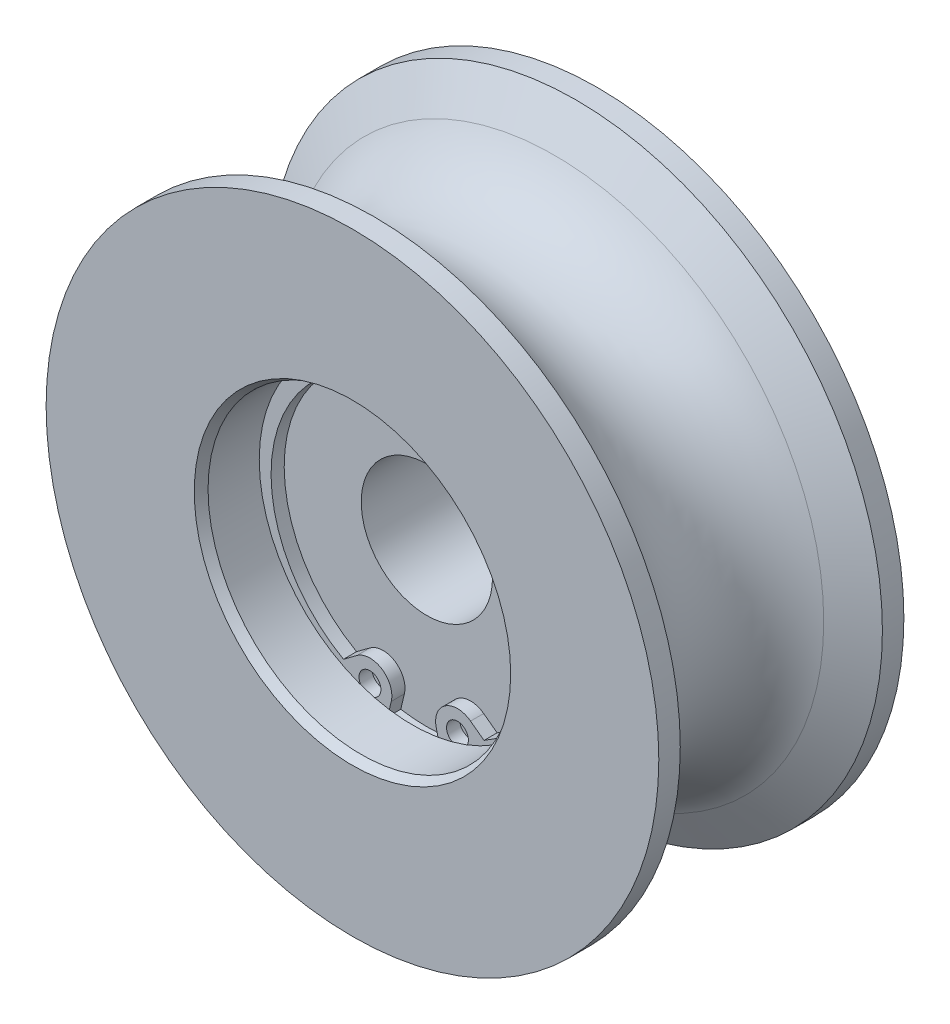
ISO-10303-21;
HEADER;
FILE_DESCRIPTION(('STEP AP214'),'2;1');
FILE_NAME('part.step','',(''),(''),'','','');
FILE_SCHEMA(('AUTOMOTIVE_DESIGN { 1 0 10303 214 1 1 1 1 }'));
ENDSEC;
DATA;
#1=APPLICATION_CONTEXT('core data for automotive mechanical design processes');
#2=APPLICATION_PROTOCOL_DEFINITION('international standard','automotive_design',2000,#1);
#3=PRODUCT_CONTEXT('',#1,'mechanical');
#4=PRODUCT('Part','Part','',(#3));
#5=PRODUCT_RELATED_PRODUCT_CATEGORY('part','',(#4));
#6=PRODUCT_DEFINITION_FORMATION('','',#4);
#7=PRODUCT_DEFINITION_CONTEXT('part definition',#1,'design');
#8=PRODUCT_DEFINITION('design','',#6,#7);
#9=PRODUCT_DEFINITION_SHAPE('','',#8);
#10=(LENGTH_UNIT() NAMED_UNIT(*) SI_UNIT(.MILLI.,.METRE.));
#11=(NAMED_UNIT(*) PLANE_ANGLE_UNIT() SI_UNIT($,.RADIAN.));
#12=(NAMED_UNIT(*) SI_UNIT($,.STERADIAN.) SOLID_ANGLE_UNIT());
#13=UNCERTAINTY_MEASURE_WITH_UNIT(LENGTH_MEASURE(1.E-05),#10,'distance_accuracy_value','');
#14=(GEOMETRIC_REPRESENTATION_CONTEXT(3) GLOBAL_UNCERTAINTY_ASSIGNED_CONTEXT((#13)) GLOBAL_UNIT_ASSIGNED_CONTEXT((#10,
#11,#12)) REPRESENTATION_CONTEXT('',''));
#15=CARTESIAN_POINT('',(0.,0.,0.));
#16=DIRECTION('',(0.,0.,1.));
#17=DIRECTION('',(1.,0.,0.));
#18=AXIS2_PLACEMENT_3D('',#15,#16,#17);
#19=CARTESIAN_POINT('',(0.,-0.9,7.1));
#20=DIRECTION('',(0.,0.,1.));
#21=DIRECTION('',(-1.,0.,0.));
#22=AXIS2_PLACEMENT_3D('',#19,#20,#21);
#23=CYLINDRICAL_SURFACE('',#22,16.3);
#24=CARTESIAN_POINT('',(0.,-0.9,7.));
#25=DIRECTION('',(0.,0.,1.));
#26=DIRECTION('',(1.,0.,0.));
#27=AXIS2_PLACEMENT_3D('',#24,#25,#26);
#28=CIRCLE('',#27,16.3);
#29=CARTESIAN_POINT('',(-8.02922574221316,-15.0852576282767,7.));
#30=VERTEX_POINT('',#29);
#31=CARTESIAN_POINT('',(8.02922574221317,-15.0852576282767,7.));
#32=VERTEX_POINT('',#31);
#33=EDGE_CURVE('E213',#30,#32,#28,.F.);
#34=ORIENTED_EDGE('',*,*,#33,.F.);
#35=DIRECTION('',(0.,0.,-1.));
#36=VECTOR('',#35,1.);
#37=CARTESIAN_POINT('',(-8.02922574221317,-15.0852576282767,7.1));
#38=LINE('',#37,#36);
#39=CARTESIAN_POINT('',(-8.02922574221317,-15.0852576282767,5.5));
#40=VERTEX_POINT('',#39);
#41=EDGE_CURVE('E127',#30,#40,#38,.T.);
#42=ORIENTED_EDGE('',*,*,#41,.T.);
#43=CARTESIAN_POINT('',(0.,-0.9,5.5));
#44=DIRECTION('',(0.,0.,-1.));
#45=DIRECTION('',(-1.,0.,0.));
#46=AXIS2_PLACEMENT_3D('',#43,#44,#45);
#47=CIRCLE('',#46,16.3);
#48=CARTESIAN_POINT('',(8.02922574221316,-15.0852576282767,5.5));
#49=VERTEX_POINT('',#48);
#50=EDGE_CURVE('E142',#40,#49,#47,.T.);
#51=ORIENTED_EDGE('',*,*,#50,.T.);
#52=DIRECTION('',(0.,0.,-1.));
#53=VECTOR('',#52,1.);
#54=CARTESIAN_POINT('',(8.02922574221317,-15.0852576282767,7.1));
#55=LINE('',#54,#53);
#56=EDGE_CURVE('E130',#32,#49,#55,.T.);
#57=ORIENTED_EDGE('',*,*,#56,.F.);
#58=EDGE_LOOP('',(#34,#42,#51,#57));
#59=FACE_BOUND('',#58,.T.);
#60=ADVANCED_FACE('F14',(#59),#23,.F.);
#61=CARTESIAN_POINT('',(6.49138441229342,-13.9421779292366,7.1));
#62=DIRECTION('',(-0.596553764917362,-0.802573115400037,0.));
#63=DIRECTION('',(-0.802573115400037,0.596553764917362,0.));
#64=AXIS2_PLACEMENT_3D('',#61,#62,#63);
#65=PLANE('',#64);
#66=DIRECTION('',(-0.802573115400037,0.596553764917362,0.));
#67=VECTOR('',#66,1.);
#68=CARTESIAN_POINT('',(6.49138441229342,-13.9421779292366,7.));
#69=LINE('',#68,#67);
#70=CARTESIAN_POINT('',(6.49138441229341,-13.9421779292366,7.));
#71=VERTEX_POINT('',#70);
#72=EDGE_CURVE('E215',#32,#71,#69,.T.);
#73=ORIENTED_EDGE('',*,*,#72,.F.);
#74=ORIENTED_EDGE('',*,*,#56,.T.);
#75=DIRECTION('',(-0.802573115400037,0.596553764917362,0.));
#76=VECTOR('',#75,1.);
#77=CARTESIAN_POINT('',(-7.95591287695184,-3.20348082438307,5.5));
#78=LINE('',#77,#76);
#79=CARTESIAN_POINT('',(6.49138441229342,-13.9421779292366,5.5));
#80=VERTEX_POINT('',#79);
#81=EDGE_CURVE('E138',#49,#80,#78,.T.);
#82=ORIENTED_EDGE('',*,*,#81,.T.);
#83=DIRECTION('',(0.,0.,-1.));
#84=VECTOR('',#83,1.);
#85=CARTESIAN_POINT('',(6.49138441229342,-13.9421779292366,7.1));
#86=LINE('',#85,#84);
#87=EDGE_CURVE('E122',#71,#80,#86,.T.);
#88=ORIENTED_EDGE('',*,*,#87,.F.);
#89=EDGE_LOOP('',(#73,#74,#82,#88));
#90=FACE_BOUND('',#89,.T.);
#91=ADVANCED_FACE('F223',(#90),#65,.F.);
#92=CARTESIAN_POINT('',(5.,-15.9486107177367,7.1));
#93=DIRECTION('',(0.,0.,1.));
#94=DIRECTION('',(-1.,0.,0.));
#95=AXIS2_PLACEMENT_3D('',#92,#93,#94);
#96=CYLINDRICAL_SURFACE('',#95,2.5);
#97=DIRECTION('',(0.,0.,-1.));
#98=VECTOR('',#97,1.);
#99=CARTESIAN_POINT('',(2.5678231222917,-16.526983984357,7.1));
#100=LINE('',#99,#98);
#101=CARTESIAN_POINT('',(2.5678231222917,-16.526983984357,7.));
#102=VERTEX_POINT('',#101);
#103=CARTESIAN_POINT('',(2.56782312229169,-16.526983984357,5.5));
#104=VERTEX_POINT('',#103);
#105=EDGE_CURVE('E40',#102,#104,#100,.T.);
#106=ORIENTED_EDGE('',*,*,#105,.F.);
#107=CARTESIAN_POINT('',(5.,-15.9486107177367,7.));
#108=DIRECTION('',(0.,0.,1.));
#109=DIRECTION('',(1.,0.,0.));
#110=AXIS2_PLACEMENT_3D('',#107,#108,#109);
#111=CIRCLE('',#110,2.5);
#112=EDGE_CURVE('E28',#102,#71,#111,.F.);
#113=ORIENTED_EDGE('',*,*,#112,.T.);
#114=ORIENTED_EDGE('',*,*,#87,.T.);
#115=CARTESIAN_POINT('',(5.,-15.9486107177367,5.5));
#116=DIRECTION('',(0.,0.,-1.));
#117=DIRECTION('',(-1.,0.,0.));
#118=AXIS2_PLACEMENT_3D('',#115,#116,#117);
#119=CIRCLE('',#118,2.5);
#120=EDGE_CURVE('E114',#104,#80,#119,.T.);
#121=ORIENTED_EDGE('',*,*,#120,.F.);
#122=EDGE_LOOP('',(#106,#113,#114,#121));
#123=FACE_BOUND('',#122,.T.);
#124=ADVANCED_FACE('F219',(#123),#96,.T.);
#125=CARTESIAN_POINT('',(-2.56782312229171,-16.526983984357,7.1));
#126=DIRECTION('',(-0.97287075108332,0.231349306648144,0.));
#127=DIRECTION('',(0.,0.,1.));
#128=AXIS2_PLACEMENT_3D('',#125,#126,#127);
#129=PLANE('',#128);
#130=DIRECTION('',(0.231349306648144,0.97287075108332,0.));
#131=VECTOR('',#130,1.);
#132=CARTESIAN_POINT('',(-2.56782312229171,-16.526983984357,7.));
#133=LINE('',#132,#131);
#134=CARTESIAN_POINT('',(-2.97957431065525,-18.2584812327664,7.));
#135=VERTEX_POINT('',#134);
#136=CARTESIAN_POINT('',(-2.5678231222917,-16.526983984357,7.));
#137=VERTEX_POINT('',#136);
#138=EDGE_CURVE('E90',#135,#137,#133,.T.);
#139=ORIENTED_EDGE('',*,*,#138,.F.);
#140=DIRECTION('',(0.,0.,1.));
#141=VECTOR('',#140,1.);
#142=CARTESIAN_POINT('',(-2.97957431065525,-18.2584812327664,17.6183293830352));
#143=LINE('',#142,#141);
#144=CARTESIAN_POINT('',(-2.97957431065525,-18.2584812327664,5.5));
#145=VERTEX_POINT('',#144);
#146=EDGE_CURVE('E101',#135,#145,#143,.F.);
#147=ORIENTED_EDGE('',*,*,#146,.T.);
#148=DIRECTION('',(0.231349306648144,0.97287075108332,0.));
#149=VECTOR('',#148,1.);
#150=CARTESIAN_POINT('',(2.97743793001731,6.79196329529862,5.5));
#151=LINE('',#150,#149);
#152=CARTESIAN_POINT('',(-2.5678231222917,-16.526983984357,5.5));
#153=VERTEX_POINT('',#152);
#154=EDGE_CURVE('E150',#145,#153,#151,.T.);
#155=ORIENTED_EDGE('',*,*,#154,.T.);
#156=DIRECTION('',(0.,0.,-1.));
#157=VECTOR('',#156,1.);
#158=CARTESIAN_POINT('',(-2.56782312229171,-16.526983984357,7.1));
#159=LINE('',#158,#157);
#160=EDGE_CURVE('E103',#137,#153,#159,.T.);
#161=ORIENTED_EDGE('',*,*,#160,.F.);
#162=EDGE_LOOP('',(#139,#147,#155,#161));
#163=FACE_BOUND('',#162,.T.);
#164=ADVANCED_FACE('F99',(#163),#129,.F.);
#165=CARTESIAN_POINT('',(-6.49138441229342,-13.9421779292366,7.1));
#166=DIRECTION('',(0.596553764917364,-0.802573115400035,0.));
#167=DIRECTION('',(0.,0.,-1.));
#168=AXIS2_PLACEMENT_3D('',#165,#166,#167);
#169=PLANE('',#168);
#170=DIRECTION('',(-0.802573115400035,-0.596553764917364,0.));
#171=VECTOR('',#170,1.);
#172=CARTESIAN_POINT('',(-6.49138441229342,-13.9421779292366,7.));
#173=LINE('',#172,#171);
#174=CARTESIAN_POINT('',(-6.49138441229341,-13.9421779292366,7.));
#175=VERTEX_POINT('',#174);
#176=EDGE_CURVE('E211',#175,#30,#173,.T.);
#177=ORIENTED_EDGE('',*,*,#176,.F.);
#178=DIRECTION('',(0.,0.,-1.));
#179=VECTOR('',#178,1.);
#180=CARTESIAN_POINT('',(-6.49138441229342,-13.9421779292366,7.1));
#181=LINE('',#180,#179);
#182=CARTESIAN_POINT('',(-6.49138441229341,-13.9421779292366,5.5));
#183=VERTEX_POINT('',#182);
#184=EDGE_CURVE('E123',#175,#183,#181,.T.);
#185=ORIENTED_EDGE('',*,*,#184,.T.);
#186=DIRECTION('',(-0.802573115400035,-0.596553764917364,0.));
#187=VECTOR('',#186,1.);
#188=CARTESIAN_POINT('',(7.95591287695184,-3.203480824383,5.5));
#189=LINE('',#188,#187);
#190=EDGE_CURVE('E146',#183,#40,#189,.T.);
#191=ORIENTED_EDGE('',*,*,#190,.T.);
#192=ORIENTED_EDGE('',*,*,#41,.F.);
#193=EDGE_LOOP('',(#177,#185,#191,#192));
#194=FACE_BOUND('',#193,.T.);
#195=ADVANCED_FACE('F241',(#194),#169,.F.);
#196=CARTESIAN_POINT('',(-5.,-15.9486107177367,7.1));
#197=DIRECTION('',(0.,0.,1.));
#198=DIRECTION('',(-1.,0.,0.));
#199=AXIS2_PLACEMENT_3D('',#196,#197,#198);
#200=CYLINDRICAL_SURFACE('',#199,2.5);
#201=ORIENTED_EDGE('',*,*,#184,.F.);
#202=CARTESIAN_POINT('',(-5.,-15.9486107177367,7.));
#203=DIRECTION('',(0.,0.,1.));
#204=DIRECTION('',(1.,0.,0.));
#205=AXIS2_PLACEMENT_3D('',#202,#203,#204);
#206=CIRCLE('',#205,2.5);
#207=EDGE_CURVE('E105',#175,#137,#206,.F.);
#208=ORIENTED_EDGE('',*,*,#207,.T.);
#209=ORIENTED_EDGE('',*,*,#160,.T.);
#210=CARTESIAN_POINT('',(-5.,-15.9486107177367,5.5));
#211=DIRECTION('',(0.,0.,-1.));
#212=DIRECTION('',(-1.,0.,0.));
#213=AXIS2_PLACEMENT_3D('',#210,#211,#212);
#214=CIRCLE('',#213,2.5);
#215=EDGE_CURVE('E152',#183,#153,#214,.T.);
#216=ORIENTED_EDGE('',*,*,#215,.F.);
#217=EDGE_LOOP('',(#201,#208,#209,#216));
#218=FACE_BOUND('',#217,.T.);
#219=ADVANCED_FACE('F16',(#218),#200,.T.);
#220=CARTESIAN_POINT('',(2.5678231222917,-16.526983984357,7.1));
#221=DIRECTION('',(0.972870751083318,0.231349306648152,0.));
#222=DIRECTION('',(0.,0.,-1.));
#223=AXIS2_PLACEMENT_3D('',#220,#221,#222);
#224=PLANE('',#223);
#225=DIRECTION('',(0.231349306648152,-0.972870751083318,0.));
#226=VECTOR('',#225,1.);
#227=CARTESIAN_POINT('',(2.5678231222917,-16.526983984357,7.));
#228=LINE('',#227,#226);
#229=CARTESIAN_POINT('',(2.97957431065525,-18.2584812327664,7.));
#230=VERTEX_POINT('',#229);
#231=EDGE_CURVE('E9',#102,#230,#228,.T.);
#232=ORIENTED_EDGE('',*,*,#231,.F.);
#233=ORIENTED_EDGE('',*,*,#105,.T.);
#234=DIRECTION('',(0.231349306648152,-0.972870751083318,0.));
#235=VECTOR('',#234,1.);
#236=CARTESIAN_POINT('',(-2.97743793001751,6.79196329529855,5.5));
#237=LINE('',#236,#235);
#238=CARTESIAN_POINT('',(2.97957431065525,-18.2584812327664,5.5));
#239=VERTEX_POINT('',#238);
#240=EDGE_CURVE('E112',#104,#239,#237,.T.);
#241=ORIENTED_EDGE('',*,*,#240,.T.);
#242=DIRECTION('',(0.,0.,1.));
#243=VECTOR('',#242,1.);
#244=CARTESIAN_POINT('',(2.97957431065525,-18.2584812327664,17.6183293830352));
#245=LINE('',#244,#243);
#246=EDGE_CURVE('E22',#239,#230,#245,.T.);
#247=ORIENTED_EDGE('',*,*,#246,.T.);
#248=EDGE_LOOP('',(#232,#233,#241,#247));
#249=FACE_BOUND('',#248,.T.);
#250=ADVANCED_FACE('F229',(#249),#224,.F.);
#251=CARTESIAN_POINT('',(0.,0.,0.));
#252=DIRECTION('',(0.,0.,1.));
#253=DIRECTION('',(1.,0.,0.));
#254=AXIS2_PLACEMENT_3D('',#251,#252,#253);
#255=TOROIDAL_SURFACE('',#254,36.,10.5);
#256=CARTESIAN_POINT('',(0.,0.,9.09326673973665));
#257=DIRECTION('',(0.,0.,1.));
#258=DIRECTION('',(1.,0.,0.));
#259=AXIS2_PLACEMENT_3D('',#256,#257,#258);
#260=CIRCLE('',#259,30.75);
#261=CARTESIAN_POINT('',(30.75,0.,9.09326673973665));
#262=VERTEX_POINT('',#261);
#263=EDGE_CURVE('E174',#262,#262,#260,.T.);
#264=ORIENTED_EDGE('',*,*,#263,.F.);
#265=EDGE_LOOP('',(#264));
#266=FACE_BOUND('',#265,.T.);
#267=CARTESIAN_POINT('',(0.,0.,-9.09326673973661));
#268=DIRECTION('',(0.,0.,1.));
#269=DIRECTION('',(1.,0.,0.));
#270=AXIS2_PLACEMENT_3D('',#267,#268,#269);
#271=CIRCLE('',#270,30.75);
#272=CARTESIAN_POINT('',(30.75,0.,-9.09326673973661));
#273=VERTEX_POINT('',#272);
#274=EDGE_CURVE('E171',#273,#273,#271,.T.);
#275=ORIENTED_EDGE('',*,*,#274,.T.);
#276=EDGE_LOOP('',(#275));
#277=FACE_BOUND('',#276,.T.);
#278=ADVANCED_FACE('F231',(#266,#277),#255,.F.);
#279=CARTESIAN_POINT('',(0.,0.,9.09326673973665));
#280=DIRECTION('',(0.,0.,1.));
#281=DIRECTION('',(1.,0.,0.));
#282=AXIS2_PLACEMENT_3D('',#279,#280,#281);
#283=CONICAL_SURFACE('',#282,30.75,1.0471975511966);
#284=CARTESIAN_POINT('',(0.,0.,11.5470053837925));
#285=DIRECTION('',(0.,0.,1.));
#286=DIRECTION('',(1.,0.,0.));
#287=AXIS2_PLACEMENT_3D('',#284,#285,#286);
#288=CIRCLE('',#287,35.);
#289=CARTESIAN_POINT('',(35.,0.,11.5470053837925));
#290=VERTEX_POINT('',#289);
#291=EDGE_CURVE('E177',#290,#290,#288,.T.);
#292=ORIENTED_EDGE('',*,*,#291,.F.);
#293=EDGE_LOOP('',(#292));
#294=FACE_BOUND('',#293,.T.);
#295=ORIENTED_EDGE('',*,*,#263,.T.);
#296=EDGE_LOOP('',(#295));
#297=FACE_BOUND('',#296,.T.);
#298=ADVANCED_FACE('F238',(#294,#297),#283,.T.);
#299=CARTESIAN_POINT('',(0.,0.,-11.5470053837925));
#300=DIRECTION('',(0.,0.,-1.));
#301=DIRECTION('',(-1.,0.,0.));
#302=AXIS2_PLACEMENT_3D('',#299,#300,#301);
#303=CONICAL_SURFACE('',#302,35.,1.0471975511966);
#304=ORIENTED_EDGE('',*,*,#274,.F.);
#305=EDGE_LOOP('',(#304));
#306=FACE_BOUND('',#305,.T.);
#307=CARTESIAN_POINT('',(0.,0.,-11.5470053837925));
#308=DIRECTION('',(0.,0.,1.));
#309=DIRECTION('',(1.,0.,0.));
#310=AXIS2_PLACEMENT_3D('',#307,#308,#309);
#311=CIRCLE('',#310,35.);
#312=CARTESIAN_POINT('',(35.,0.,-11.5470053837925));
#313=VERTEX_POINT('',#312);
#314=EDGE_CURVE('E164',#313,#313,#311,.T.);
#315=ORIENTED_EDGE('',*,*,#314,.T.);
#316=EDGE_LOOP('',(#315));
#317=FACE_BOUND('',#316,.T.);
#318=ADVANCED_FACE('F324',(#306,#317),#303,.T.);
#319=CARTESIAN_POINT('',(0.,0.,17.6183293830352));
#320=DIRECTION('',(0.,0.,1.));
#321=DIRECTION('',(1.,0.,0.));
#322=AXIS2_PLACEMENT_3D('',#319,#320,#321);
#323=CYLINDRICAL_SURFACE('',#322,35.);
#324=CARTESIAN_POINT('',(0.,0.,14.));
#325=DIRECTION('',(0.,0.,1.));
#326=DIRECTION('',(1.,0.,0.));
#327=AXIS2_PLACEMENT_3D('',#324,#325,#326);
#328=CIRCLE('',#327,35.);
#329=CARTESIAN_POINT('',(35.,0.,14.));
#330=VERTEX_POINT('',#329);
#331=EDGE_CURVE('E180',#330,#330,#328,.T.);
#332=ORIENTED_EDGE('',*,*,#331,.F.);
#333=EDGE_LOOP('',(#332));
#334=FACE_BOUND('',#333,.T.);
#335=ORIENTED_EDGE('',*,*,#291,.T.);
#336=EDGE_LOOP('',(#335));
#337=FACE_BOUND('',#336,.T.);
#338=ADVANCED_FACE('F321',(#334,#337),#323,.T.);
#339=CARTESIAN_POINT('',(0.,0.,17.6183293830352));
#340=DIRECTION('',(0.,0.,1.));
#341=DIRECTION('',(1.,0.,0.));
#342=AXIS2_PLACEMENT_3D('',#339,#340,#341);
#343=CYLINDRICAL_SURFACE('',#342,35.);
#344=ORIENTED_EDGE('',*,*,#314,.F.);
#345=EDGE_LOOP('',(#344));
#346=FACE_BOUND('',#345,.T.);
#347=CARTESIAN_POINT('',(0.,0.,-14.));
#348=DIRECTION('',(0.,0.,1.));
#349=DIRECTION('',(1.,0.,0.));
#350=AXIS2_PLACEMENT_3D('',#347,#348,#349);
#351=CIRCLE('',#350,35.);
#352=CARTESIAN_POINT('',(35.,0.,-14.));
#353=VERTEX_POINT('',#352);
#354=EDGE_CURVE('E168',#353,#353,#351,.T.);
#355=ORIENTED_EDGE('',*,*,#354,.T.);
#356=EDGE_LOOP('',(#355));
#357=FACE_BOUND('',#356,.T.);
#358=ADVANCED_FACE('F319',(#346,#357),#343,.T.);
#359=CARTESIAN_POINT('',(0.,35.,14.));
#360=DIRECTION('',(0.,0.,-1.));
#361=DIRECTION('',(-1.,0.,0.));
#362=AXIS2_PLACEMENT_3D('',#359,#360,#361);
#363=PLANE('',#362);
#364=CARTESIAN_POINT('',(0.,0.,14.));
#365=DIRECTION('',(0.,0.,1.));
#366=DIRECTION('',(1.,0.,0.));
#367=AXIS2_PLACEMENT_3D('',#364,#365,#366);
#368=CIRCLE('',#367,18.0773502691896);
#369=CARTESIAN_POINT('',(18.0773502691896,0.,14.));
#370=VERTEX_POINT('',#369);
#371=EDGE_CURVE('E183',#370,#370,#368,.T.);
#372=ORIENTED_EDGE('',*,*,#371,.F.);
#373=EDGE_LOOP('',(#372));
#374=FACE_BOUND('',#373,.T.);
#375=ORIENTED_EDGE('',*,*,#331,.T.);
#376=EDGE_LOOP('',(#375));
#377=FACE_BOUND('',#376,.T.);
#378=ADVANCED_FACE('F296',(#374,#377),#363,.F.);
#379=CARTESIAN_POINT('',(0.,14.5,-14.));
#380=DIRECTION('',(0.,0.,1.));
#381=DIRECTION('',(1.,0.,0.));
#382=AXIS2_PLACEMENT_3D('',#379,#380,#381);
#383=PLANE('',#382);
#384=ORIENTED_EDGE('',*,*,#354,.F.);
#385=EDGE_LOOP('',(#384));
#386=FACE_BOUND('',#385,.T.);
#387=CARTESIAN_POINT('',(0.,0.,-14.));
#388=DIRECTION('',(0.,0.,1.));
#389=DIRECTION('',(1.,0.,0.));
#390=AXIS2_PLACEMENT_3D('',#387,#388,#389);
#391=CIRCLE('',#390,14.5);
#392=CARTESIAN_POINT('',(14.5,0.,-14.));
#393=VERTEX_POINT('',#392);
#394=EDGE_CURVE('E199',#393,#393,#391,.T.);
#395=ORIENTED_EDGE('',*,*,#394,.T.);
#396=EDGE_LOOP('',(#395));
#397=FACE_BOUND('',#396,.T.);
#398=ADVANCED_FACE('F292',(#386,#397),#383,.F.);
#399=CARTESIAN_POINT('',(0.,0.,14.));
#400=DIRECTION('',(0.,0.,1.));
#401=DIRECTION('',(1.,0.,0.));
#402=AXIS2_PLACEMENT_3D('',#399,#400,#401);
#403=CONICAL_SURFACE('',#402,18.0773502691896,0.523598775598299);
#404=CARTESIAN_POINT('',(0.,0.,13.));
#405=DIRECTION('',(0.,0.,1.));
#406=DIRECTION('',(1.,0.,0.));
#407=AXIS2_PLACEMENT_3D('',#404,#405,#406);
#408=CIRCLE('',#407,17.5);
#409=CARTESIAN_POINT('',(17.5,0.,13.));
#410=VERTEX_POINT('',#409);
#411=EDGE_CURVE('E186',#410,#410,#408,.T.);
#412=ORIENTED_EDGE('',*,*,#411,.F.);
#413=EDGE_LOOP('',(#412));
#414=FACE_BOUND('',#413,.T.);
#415=ORIENTED_EDGE('',*,*,#371,.T.);
#416=EDGE_LOOP('',(#415));
#417=FACE_BOUND('',#416,.T.);
#418=ADVANCED_FACE('F295',(#414,#417),#403,.F.);
#419=CARTESIAN_POINT('',(0.,0.,17.6183293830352));
#420=DIRECTION('',(0.,0.,1.));
#421=DIRECTION('',(1.,0.,0.));
#422=AXIS2_PLACEMENT_3D('',#419,#420,#421);
#423=CYLINDRICAL_SURFACE('',#422,14.5);
#424=ORIENTED_EDGE('',*,*,#394,.F.);
#425=EDGE_LOOP('',(#424));
#426=FACE_BOUND('',#425,.T.);
#427=CARTESIAN_POINT('',(0.,0.,-5.5));
#428=DIRECTION('',(0.,0.,1.));
#429=DIRECTION('',(1.,0.,0.));
#430=AXIS2_PLACEMENT_3D('',#427,#428,#429);
#431=CIRCLE('',#430,14.5);
#432=CARTESIAN_POINT('',(14.5,0.,-5.5));
#433=VERTEX_POINT('',#432);
#434=EDGE_CURVE('E196',#433,#433,#431,.T.);
#435=ORIENTED_EDGE('',*,*,#434,.T.);
#436=EDGE_LOOP('',(#435));
#437=FACE_BOUND('',#436,.T.);
#438=ADVANCED_FACE('F298',(#426,#437),#423,.F.);
#439=CARTESIAN_POINT('',(0.,0.,17.6183293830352));
#440=DIRECTION('',(0.,0.,1.));
#441=DIRECTION('',(1.,0.,0.));
#442=AXIS2_PLACEMENT_3D('',#439,#440,#441);
#443=CYLINDRICAL_SURFACE('',#442,17.5);
#444=CARTESIAN_POINT('',(0.,0.,7.15));
#445=DIRECTION('',(0.,0.,1.));
#446=DIRECTION('',(1.,0.,0.));
#447=AXIS2_PLACEMENT_3D('',#444,#445,#446);
#448=CIRCLE('',#447,17.5);
#449=CARTESIAN_POINT('',(17.5,0.,7.15));
#450=VERTEX_POINT('',#449);
#451=EDGE_CURVE('E165',#450,#450,#448,.F.);
#452=ORIENTED_EDGE('',*,*,#451,.T.);
#453=EDGE_LOOP('',(#452));
#454=FACE_BOUND('',#453,.T.);
#455=ORIENTED_EDGE('',*,*,#411,.T.);
#456=EDGE_LOOP('',(#455));
#457=FACE_BOUND('',#456,.T.);
#458=ADVANCED_FACE('F301',(#454,#457),#443,.F.);
#459=CARTESIAN_POINT('',(0.,14.5,-5.5));
#460=DIRECTION('',(0.,0.,1.));
#461=DIRECTION('',(1.,0.,0.));
#462=AXIS2_PLACEMENT_3D('',#459,#460,#461);
#463=PLANE('',#462);
#464=ORIENTED_EDGE('',*,*,#434,.F.);
#465=EDGE_LOOP('',(#464));
#466=FACE_BOUND('',#465,.T.);
#467=CARTESIAN_POINT('',(0.,0.,-5.5));
#468=DIRECTION('',(0.,0.,1.));
#469=DIRECTION('',(1.,0.,0.));
#470=AXIS2_PLACEMENT_3D('',#467,#468,#469);
#471=CIRCLE('',#470,7.5);
#472=CARTESIAN_POINT('',(7.5,0.,-5.5));
#473=VERTEX_POINT('',#472);
#474=EDGE_CURVE('E193',#473,#473,#471,.T.);
#475=ORIENTED_EDGE('',*,*,#474,.T.);
#476=EDGE_LOOP('',(#475));
#477=FACE_BOUND('',#476,.T.);
#478=ADVANCED_FACE('F290',(#466,#477),#463,.F.);
#479=CARTESIAN_POINT('',(0.,0.,7.15));
#480=DIRECTION('',(0.,0.,1.));
#481=DIRECTION('',(1.,0.,0.));
#482=AXIS2_PLACEMENT_3D('',#479,#480,#481);
#483=PLANE('',#482);
#484=CARTESIAN_POINT('',(0.,0.,7.15));
#485=DIRECTION('',(0.,0.,1.));
#486=DIRECTION('',(1.,0.,0.));
#487=AXIS2_PLACEMENT_3D('',#484,#485,#486);
#488=CIRCLE('',#487,18.5);
#489=CARTESIAN_POINT('',(18.5,0.,7.15));
#490=VERTEX_POINT('',#489);
#491=EDGE_CURVE('E126',#490,#490,#488,.T.);
#492=ORIENTED_EDGE('',*,*,#491,.F.);
#493=EDGE_LOOP('',(#492));
#494=FACE_BOUND('',#493,.T.);
#495=ORIENTED_EDGE('',*,*,#451,.F.);
#496=EDGE_LOOP('',(#495));
#497=FACE_BOUND('',#496,.T.);
#498=ADVANCED_FACE('F287',(#494,#497),#483,.F.);
#499=CARTESIAN_POINT('',(0.,0.,17.6183293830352));
#500=DIRECTION('',(0.,0.,1.));
#501=DIRECTION('',(1.,0.,0.));
#502=AXIS2_PLACEMENT_3D('',#499,#500,#501);
#503=CYLINDRICAL_SURFACE('',#502,18.5);
#504=CARTESIAN_POINT('',(0.,0.,7.));
#505=DIRECTION('',(0.,0.,1.));
#506=DIRECTION('',(1.,0.,0.));
#507=AXIS2_PLACEMENT_3D('',#504,#505,#506);
#508=CIRCLE('',#507,18.5);
#509=EDGE_CURVE('E86',#230,#135,#508,.T.);
#510=ORIENTED_EDGE('',*,*,#509,.F.);
#511=ORIENTED_EDGE('',*,*,#246,.F.);
#512=CARTESIAN_POINT('',(0.,0.,5.5));
#513=DIRECTION('',(0.,0.,1.));
#514=DIRECTION('',(1.,0.,0.));
#515=AXIS2_PLACEMENT_3D('',#512,#513,#514);
#516=CIRCLE('',#515,18.5);
#517=EDGE_CURVE('E111',#145,#239,#516,.T.);
#518=ORIENTED_EDGE('',*,*,#517,.F.);
#519=ORIENTED_EDGE('',*,*,#146,.F.);
#520=EDGE_LOOP('',(#510,#511,#518,#519));
#521=FACE_BOUND('',#520,.T.);
#522=ORIENTED_EDGE('',*,*,#491,.T.);
#523=EDGE_LOOP('',(#522));
#524=FACE_BOUND('',#523,.T.);
#525=ADVANCED_FACE('F108',(#521,#524),#503,.F.);
#526=CARTESIAN_POINT('',(0.,0.,17.6183293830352));
#527=DIRECTION('',(0.,0.,1.));
#528=DIRECTION('',(1.,0.,0.));
#529=AXIS2_PLACEMENT_3D('',#526,#527,#528);
#530=CYLINDRICAL_SURFACE('',#529,7.5);
#531=ORIENTED_EDGE('',*,*,#474,.F.);
#532=EDGE_LOOP('',(#531));
#533=FACE_BOUND('',#532,.T.);
#534=CARTESIAN_POINT('',(0.,0.,5.5));
#535=DIRECTION('',(0.,0.,1.));
#536=DIRECTION('',(1.,0.,0.));
#537=AXIS2_PLACEMENT_3D('',#534,#535,#536);
#538=CIRCLE('',#537,7.5);
#539=CARTESIAN_POINT('',(7.5,0.,5.5));
#540=VERTEX_POINT('',#539);
#541=EDGE_CURVE('E190',#540,#540,#538,.T.);
#542=ORIENTED_EDGE('',*,*,#541,.T.);
#543=EDGE_LOOP('',(#542));
#544=FACE_BOUND('',#543,.T.);
#545=ADVANCED_FACE('F284',(#533,#544),#530,.F.);
#546=CARTESIAN_POINT('',(0.,7.5,5.5));
#547=DIRECTION('',(0.,0.,-1.));
#548=DIRECTION('',(-1.,0.,0.));
#549=AXIS2_PLACEMENT_3D('',#546,#547,#548);
#550=PLANE('',#549);
#551=ORIENTED_EDGE('',*,*,#541,.F.);
#552=EDGE_LOOP('',(#551));
#553=FACE_BOUND('',#552,.T.);
#554=ORIENTED_EDGE('',*,*,#240,.F.);
#555=ORIENTED_EDGE('',*,*,#120,.T.);
#556=ORIENTED_EDGE('',*,*,#81,.F.);
#557=ORIENTED_EDGE('',*,*,#50,.F.);
#558=ORIENTED_EDGE('',*,*,#190,.F.);
#559=ORIENTED_EDGE('',*,*,#215,.T.);
#560=ORIENTED_EDGE('',*,*,#154,.F.);
#561=ORIENTED_EDGE('',*,*,#517,.T.);
#562=EDGE_LOOP('',(#554,#555,#556,#557,#558,#559,#560,#561));
#563=FACE_BOUND('',#562,.T.);
#564=ADVANCED_FACE('F228',(#553,#563),#550,.F.);
#565=CARTESIAN_POINT('',(0.,0.,7.));
#566=DIRECTION('',(0.,0.,1.));
#567=DIRECTION('',(1.,0.,0.));
#568=AXIS2_PLACEMENT_3D('',#565,#566,#567);
#569=PLANE('',#568);
#570=ORIENTED_EDGE('',*,*,#138,.T.);
#571=ORIENTED_EDGE('',*,*,#207,.F.);
#572=ORIENTED_EDGE('',*,*,#176,.T.);
#573=ORIENTED_EDGE('',*,*,#33,.T.);
#574=ORIENTED_EDGE('',*,*,#72,.T.);
#575=ORIENTED_EDGE('',*,*,#112,.F.);
#576=ORIENTED_EDGE('',*,*,#231,.T.);
#577=ORIENTED_EDGE('',*,*,#509,.T.);
#578=EDGE_LOOP('',(#570,#571,#572,#573,#574,#575,#576,#577));
#579=FACE_BOUND('',#578,.T.);
#580=CARTESIAN_POINT('',(-5.,-15.9486107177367,7.));
#581=DIRECTION('',(0.,0.,1.));
#582=DIRECTION('',(1.,0.,0.));
#583=AXIS2_PLACEMENT_3D('',#580,#581,#582);
#584=CIRCLE('',#583,1.25);
#585=CARTESIAN_POINT('',(-3.75,-15.9486107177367,7.));
#586=VERTEX_POINT('',#585);
#587=EDGE_CURVE('E104',#586,#586,#584,.F.);
#588=ORIENTED_EDGE('',*,*,#587,.T.);
#589=EDGE_LOOP('',(#588));
#590=FACE_BOUND('',#589,.T.);
#591=CARTESIAN_POINT('',(5.,-15.9486107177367,7.));
#592=DIRECTION('',(0.,0.,1.));
#593=DIRECTION('',(1.,0.,0.));
#594=AXIS2_PLACEMENT_3D('',#591,#592,#593);
#595=CIRCLE('',#594,1.25);
#596=CARTESIAN_POINT('',(6.25,-15.9486107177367,7.));
#597=VERTEX_POINT('',#596);
#598=EDGE_CURVE('E119',#597,#597,#595,.F.);
#599=ORIENTED_EDGE('',*,*,#598,.T.);
#600=EDGE_LOOP('',(#599));
#601=FACE_BOUND('',#600,.T.);
#602=ADVANCED_FACE('F88',(#579,#590,#601),#569,.T.);
#603=CARTESIAN_POINT('',(-5.,-15.9486107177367,5.5));
#604=DIRECTION('',(0.,0.,-1.));
#605=DIRECTION('',(-1.,0.,0.));
#606=AXIS2_PLACEMENT_3D('',#603,#604,#605);
#607=CIRCLE('',#606,1.25);
#608=CARTESIAN_POINT('',(-6.25,-15.9486107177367,5.5));
#609=VERTEX_POINT('',#608);
#610=EDGE_CURVE('E156',#609,#609,#607,.T.);
#611=ORIENTED_EDGE('',*,*,#610,.F.);
#612=EDGE_LOOP('',(#611));
#613=FACE_BOUND('',#612,.T.);
#614=ADVANCED_FACE('F264',(#613),#550,.F.);
#615=CARTESIAN_POINT('',(-5.,-15.9486107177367,7.1));
#616=DIRECTION('',(0.,0.,1.));
#617=DIRECTION('',(-1.,0.,0.));
#618=AXIS2_PLACEMENT_3D('',#615,#616,#617);
#619=CYLINDRICAL_SURFACE('',#618,1.25);
#620=ORIENTED_EDGE('',*,*,#610,.T.);
#621=EDGE_LOOP('',(#620));
#622=FACE_BOUND('',#621,.T.);
#623=ORIENTED_EDGE('',*,*,#587,.F.);
#624=EDGE_LOOP('',(#623));
#625=FACE_BOUND('',#624,.T.);
#626=ADVANCED_FACE('F262',(#622,#625),#619,.F.);
#627=CARTESIAN_POINT('',(5.,-15.9486107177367,5.5));
#628=DIRECTION('',(0.,0.,-1.));
#629=DIRECTION('',(-1.,0.,0.));
#630=AXIS2_PLACEMENT_3D('',#627,#628,#629);
#631=CIRCLE('',#630,1.25);
#632=CARTESIAN_POINT('',(3.75,-15.9486107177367,5.5));
#633=VERTEX_POINT('',#632);
#634=EDGE_CURVE('E160',#633,#633,#631,.T.);
#635=ORIENTED_EDGE('',*,*,#634,.F.);
#636=EDGE_LOOP('',(#635));
#637=FACE_BOUND('',#636,.T.);
#638=ADVANCED_FACE('F258',(#637),#550,.F.);
#639=CARTESIAN_POINT('',(5.,-15.9486107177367,7.1));
#640=DIRECTION('',(0.,0.,1.));
#641=DIRECTION('',(-1.,0.,0.));
#642=AXIS2_PLACEMENT_3D('',#639,#640,#641);
#643=CYLINDRICAL_SURFACE('',#642,1.25);
#644=ORIENTED_EDGE('',*,*,#634,.T.);
#645=EDGE_LOOP('',(#644));
#646=FACE_BOUND('',#645,.T.);
#647=ORIENTED_EDGE('',*,*,#598,.F.);
#648=EDGE_LOOP('',(#647));
#649=FACE_BOUND('',#648,.T.);
#650=ADVANCED_FACE('F255',(#646,#649),#643,.F.);
#651=CLOSED_SHELL('',(#60,#91,#124,#164,#195,#219,#250,#278,#298,#318,#338,#358,#378,#398,#418,
#438,#458,#478,#498,#525,#545,#564,#602,#614,#626,#638,#650));
#652=MANIFOLD_SOLID_BREP('B1',#651);
#653=ADVANCED_BREP_SHAPE_REPRESENTATION('',(#18,#652),#14);
#654=SHAPE_DEFINITION_REPRESENTATION(#9,#653);
ENDSEC;
END-ISO-10303-21;
